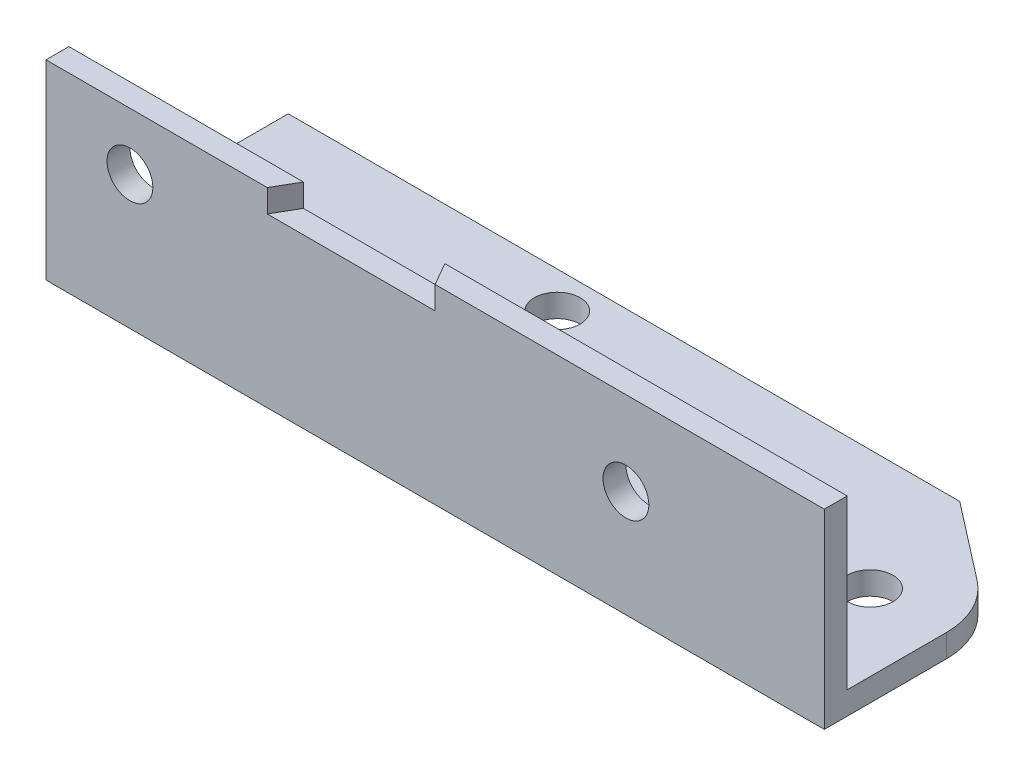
from build123d import *

# Parameters (mm, degrees)
SKETCH1_R          = 3
EXTRUDE1_DEPTH     = 3
SKETCH2_W          = 102
SKETCH2_H          = 3
EXTRUDE2_DEPTH     = 22
SKETCH3_R          = 3
CUT_EXTRUDE1_DEPTH = 109.883251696
CUT_EXTRUDE2_DEPTH = 3
SKETCH5_R          = 3
CUT_EXTRUDE3_DEPTH = 109.883251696


with BuildPart() as part:
    # Sketch1 → Extrude1 (new body)
    with BuildSketch(Plane(origin=(0, 0, 0), x_dir=(1, 0, 0), z_dir=(0, 1, 0))):
        with BuildLine():
            Line((0, 0), (102, 0))
            Line((102, 0), (102, 16))
            ThreePointArc((102, 16), (100.979127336, 20.401735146), (98.124945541, 23.904748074))
            Line((98.124945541, 23.904748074), (88, 31.75))
            Line((88, 31.75), (0, 31.75))
            Line((0, 31.75), (0, 0))
        make_face()
        with Locations(Location((40, 27, 0), (0, 0, 270))):
            Circle(SKETCH1_R, mode=Mode.SUBTRACT)
        with Locations(Location((92, 16, 0), (0, 0, 270))):
            Circle(SKETCH1_R, mode=Mode.SUBTRACT)
    extrude(amount=EXTRUDE1_DEPTH)

    # Sketch2 → Extrude2 (add)
    with BuildSketch(Plane(origin=(0, 3, 0), x_dir=(-1, 0, 0), z_dir=(0, 1, 0))):
        with Locations((-51, -1.5)):
            Rectangle(SKETCH2_W, SKETCH2_H)
    extrude(amount=EXTRUDE2_DEPTH)

    # Sketch3 → Cut-Extrude1 (cut, through all)
    with BuildSketch(Plane(origin=(0, 0, -3), x_dir=(-1, 0, 0), z_dir=(0, 0, -1))):
        with Locations((-11, 17.5)):
            Circle(SKETCH3_R)
    extrude(amount=-CUT_EXTRUDE1_DEPTH, mode=Mode.SUBTRACT)

    # Sketch4 → Cut-Extrude2 (cut)
    with BuildSketch(Plane(origin=(0, 25, 0), x_dir=(-1, 0, 0), z_dir=(0, 1, 0))):
        Polygon((-29, 0), (-33.618802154, -8), (-46.381197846, -8), (-51, 0), align=None)
    extrude(amount=-CUT_EXTRUDE2_DEPTH, mode=Mode.SUBTRACT)

    # Sketch5 → Cut-Extrude3 (cut, through all)
    with BuildSketch(Plane(origin=(0, 0, -3), x_dir=(-1, 0, 0), z_dir=(0, 0, -1))):
        with Locations((-76, 14)):
            Circle(SKETCH5_R)
    extrude(amount=-CUT_EXTRUDE3_DEPTH, mode=Mode.SUBTRACT)


solid = part.part
